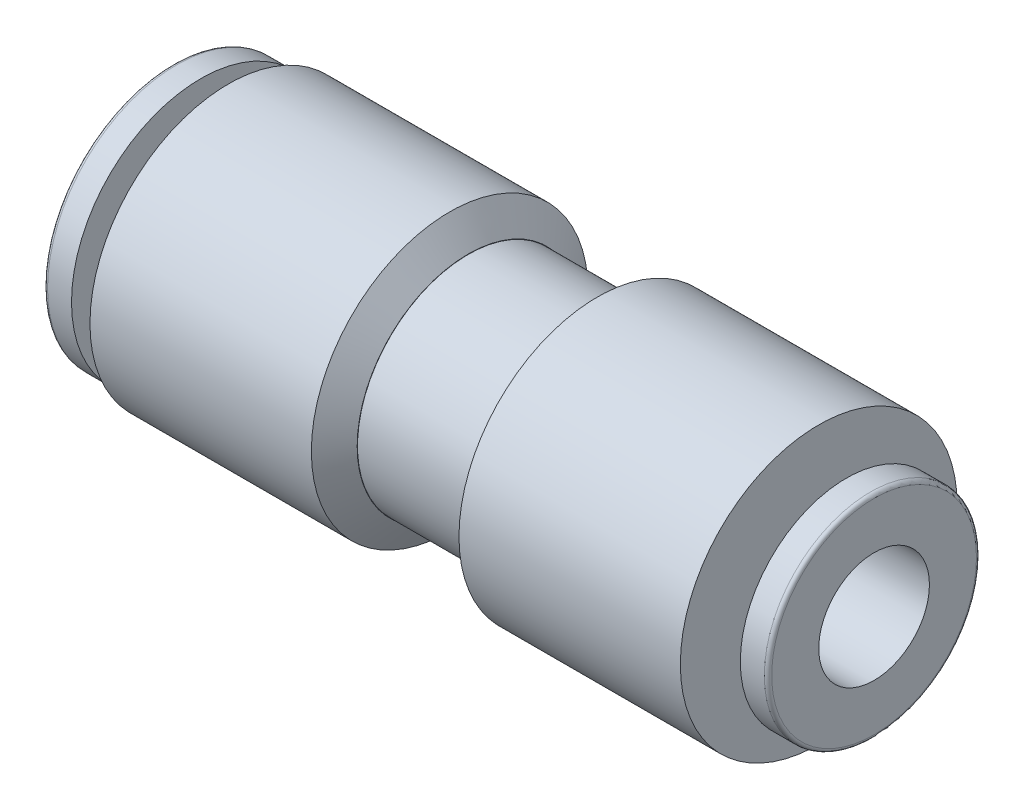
from build123d import *

# Parameters (mm, degrees)
SKETCH1_R           = 7.5
BOSS_EXTRUDE1_DEPTH = 13
SKETCH2_R           = 6
BOSS_EXTRUDE2_DEPTH = 6
SKETCH3_R           = 7.5
BOSS_EXTRUDE3_DEPTH = 13
SKETCH4_R           = 3.5
BOSS_EXTRUDE4_DEPTH = 1.5
SKETCH5_R           = 5.75
BOSS_EXTRUDE5_DEPTH = 1.5
SKETCH6_R           = 4.5
BOSS_EXTRUDE6_DEPTH = 1.5
SKETCH7_R           = 7
BOSS_EXTRUDE7_DEPTH = 1.5
SKETCH8_R           = 3
CUT_EXTRUDE1_DEPTH  = 19
SKETCH9_R           = 4
CUT_EXTRUDE2_DEPTH  = 19
CHAMFER2_SIZE       = 1
CHAMFER2_SIZE2      = 1.482560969
CHAMFER4_SIZE       = 1
CHAMFER4_SIZE2      = 1.482560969
FILLET1_R           = 0.2


with BuildPart() as part:
    # Sketch1 → Boss-Extrude1 (new body)
    with BuildSketch(Plane(origin=(0, 0, 0), x_dir=(0, 0, -1), z_dir=(1, 0, 0))):
        with Locations(Location((0, 0, 0), (0, 0, 180))):
            Circle(SKETCH1_R)
    extrude(amount=BOSS_EXTRUDE1_DEPTH)

    # Sketch2 → Boss-Extrude2 (add)
    with BuildSketch(Plane(origin=(13, 0, 0), x_dir=(0, 0, -1), z_dir=(1, 0, 0))):
        Circle(SKETCH2_R)
    extrude(amount=BOSS_EXTRUDE2_DEPTH)

    # Sketch3 → Boss-Extrude3 (add)
    with BuildSketch(Plane(origin=(19, 0, 0), x_dir=(0, 0, -1), z_dir=(1, 0, 0))):
        with Locations(Location((0, 0, 0), (0, 0, 180))):
            Circle(SKETCH3_R)
    extrude(amount=BOSS_EXTRUDE3_DEPTH)

    # Sketch4 → Boss-Extrude4 (add)
    with BuildSketch(Plane(origin=(32, 0, 0), x_dir=(0, 0, -1), z_dir=(1, 0, 0))):
        Circle(SKETCH4_R)
    extrude(amount=BOSS_EXTRUDE4_DEPTH)

    # Sketch5 → Boss-Extrude5 (add)
    with BuildSketch(Plane(origin=(33.5, 0, 0), x_dir=(0, 0, -1), z_dir=(1, 0, 0))):
        Circle(SKETCH5_R)
    extrude(amount=BOSS_EXTRUDE5_DEPTH)

    # Sketch6 → Boss-Extrude6 (add)
    with BuildSketch(Plane.ZY):
        with Locations(Location((0, 0, 0), (0, 0, 180))):
            Circle(SKETCH6_R)
    extrude(amount=BOSS_EXTRUDE6_DEPTH)

    # Sketch7 → Boss-Extrude7 (add)
    with BuildSketch(Plane.ZY.offset(1.5)):
        Circle(SKETCH7_R)
    extrude(amount=BOSS_EXTRUDE7_DEPTH)

    # Sketch8 → Cut-Extrude1 (cut)
    with BuildSketch(Plane(origin=(35, 0, 0), x_dir=(0, 0, -1), z_dir=(1, 0, 0))):
        Circle(SKETCH8_R)
    extrude(amount=-CUT_EXTRUDE1_DEPTH, mode=Mode.SUBTRACT)

    # Sketch9 → Cut-Extrude2 (cut)
    with BuildSketch(Plane.ZY.offset(3)):
        Circle(SKETCH9_R)
    extrude(amount=-CUT_EXTRUDE2_DEPTH, mode=Mode.SUBTRACT)

    # Chamfer2
    chamfer2_edges = [part.edges().sort_by_distance(p)[0] for p in [
        (13, 0, -7.5),
    ]]
    chamfer2_side = [part.faces().sort_by_distance(p)[0] for p in [
        (6.5, 0, -7.5),
    ]]
    chamfer(chamfer2_edges, length=CHAMFER2_SIZE, length2=CHAMFER2_SIZE2, reference=chamfer2_side[0])

    # Chamfer4
    chamfer4_edges = [part.edges().sort_by_distance(p)[0] for p in [
        (19, 0, -7.5),
    ]]
    chamfer4_side = [part.faces().sort_by_distance(p)[0] for p in [
        (25.5, 0, -7.5),
    ]]
    chamfer(chamfer4_edges, length=CHAMFER4_SIZE, length2=CHAMFER4_SIZE2, reference=chamfer4_side[0])

    # Fillet1
    fillet1_edges = [part.edges().sort_by_distance(p)[0] for p in [
        (35, 0, 5.75),
        (-3, 0, -7),
    ]]
    fillet(fillet1_edges, radius=FILLET1_R)


solid = part.part
